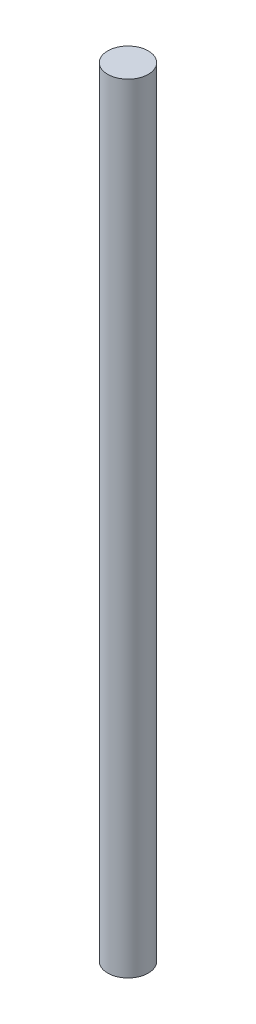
from build123d import *

# Parameters (mm, degrees)
SKETCH1_R           = 2.609499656
BOSS_EXTRUDE1_DEPTH = 100


with BuildPart() as part:
    # Sketch1 → Boss-Extrude1 (new body)
    with BuildSketch(Plane(origin=(0, 0, 0), x_dir=(1, 0, 0), z_dir=(0, 1, 0))):
        with Locations(Location((0, 0, 0), (0, 0, 270))):
            Circle(SKETCH1_R)
    extrude(amount=BOSS_EXTRUDE1_DEPTH)


solid = part.part
